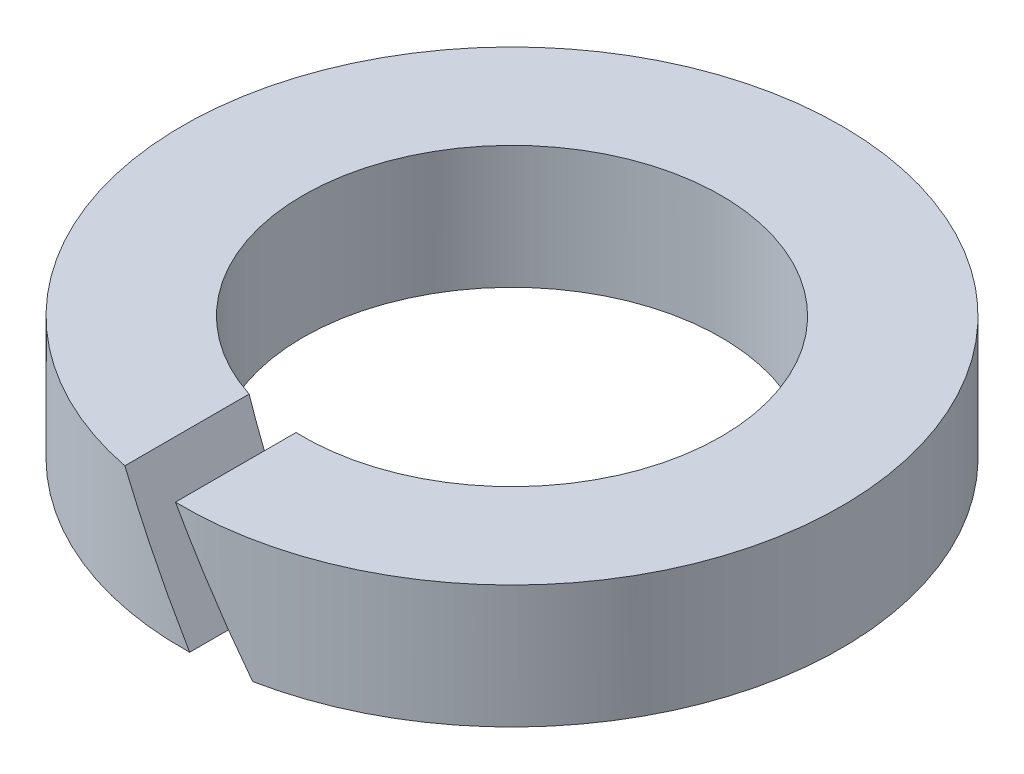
ISO-10303-21;
HEADER;
FILE_DESCRIPTION(('STEP AP214'),'2;1');
FILE_NAME('part.step','',(''),(''),'','','');
FILE_SCHEMA(('AUTOMOTIVE_DESIGN { 1 0 10303 214 1 1 1 1 }'));
ENDSEC;
DATA;
#1=APPLICATION_CONTEXT('core data for automotive mechanical design processes');
#2=APPLICATION_PROTOCOL_DEFINITION('international standard','automotive_design',2000,#1);
#3=PRODUCT_CONTEXT('',#1,'mechanical');
#4=PRODUCT('Part','Part','',(#3));
#5=PRODUCT_RELATED_PRODUCT_CATEGORY('part','',(#4));
#6=PRODUCT_DEFINITION_FORMATION('','',#4);
#7=PRODUCT_DEFINITION_CONTEXT('part definition',#1,'design');
#8=PRODUCT_DEFINITION('design','',#6,#7);
#9=PRODUCT_DEFINITION_SHAPE('','',#8);
#10=(LENGTH_UNIT() NAMED_UNIT(*) SI_UNIT(.MILLI.,.METRE.));
#11=(NAMED_UNIT(*) PLANE_ANGLE_UNIT() SI_UNIT($,.RADIAN.));
#12=(NAMED_UNIT(*) SI_UNIT($,.STERADIAN.) SOLID_ANGLE_UNIT());
#13=UNCERTAINTY_MEASURE_WITH_UNIT(LENGTH_MEASURE(1.E-05),#10,'distance_accuracy_value','');
#14=(GEOMETRIC_REPRESENTATION_CONTEXT(3) GLOBAL_UNCERTAINTY_ASSIGNED_CONTEXT((#13)) GLOBAL_UNIT_ASSIGNED_CONTEXT((#10,
#11,#12)) REPRESENTATION_CONTEXT('',''));
#15=CARTESIAN_POINT('',(0.,0.,0.));
#16=DIRECTION('',(0.,0.,1.));
#17=DIRECTION('',(1.,0.,0.));
#18=AXIS2_PLACEMENT_3D('',#15,#16,#17);
#19=CARTESIAN_POINT('',(0.,80.,-6.66133814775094E-13));
#20=DIRECTION('',(0.,1.,0.));
#21=DIRECTION('',(0.,0.,1.00000000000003));
#22=AXIS2_PLACEMENT_3D('',#19,#20,#21);
#23=CYLINDRICAL_SURFACE('',#22,4.25000000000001);
#24=CARTESIAN_POINT('',(0.,1.00000000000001,0.));
#25=DIRECTION('',(-0.866025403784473,-0.499999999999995,0.));
#26=DIRECTION('',(-0.500000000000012,0.866025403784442,0.));
#27=AXIS2_PLACEMENT_3D('',#24,#25,#26);
#28=ELLIPSE('',#27,8.5000000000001,4.25000000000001);
#29=CARTESIAN_POINT('',(1.29903810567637,-1.24999999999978,4.04660351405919));
#30=VERTEX_POINT('',#29);
#31=CARTESIAN_POINT('',(-0.144337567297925,1.25,4.24754831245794));
#32=VERTEX_POINT('',#31);
#33=EDGE_CURVE('E88',#30,#32,#28,.T.);
#34=ORIENTED_EDGE('',*,*,#33,.T.);
#35=CARTESIAN_POINT('',(0.,1.25,0.));
#36=DIRECTION('',(0.,1.,0.));
#37=DIRECTION('',(0.,0.,1.00000000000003));
#38=AXIS2_PLACEMENT_3D('',#35,#36,#37);
#39=CIRCLE('',#38,4.25000000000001);
#40=CARTESIAN_POINT('',(-1.29903810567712,1.25000000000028,4.04660351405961));
#41=VERTEX_POINT('',#40);
#42=EDGE_CURVE('E92',#32,#41,#39,.T.);
#43=ORIENTED_EDGE('',*,*,#42,.T.);
#44=CARTESIAN_POINT('',(0.,-1.00000000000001,0.));
#45=DIRECTION('',(-0.866025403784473,-0.499999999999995,0.));
#46=DIRECTION('',(-0.500000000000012,0.866025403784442,0.));
#47=AXIS2_PLACEMENT_3D('',#44,#45,#46);
#48=ELLIPSE('',#47,8.50000000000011,4.25000000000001);
#49=CARTESIAN_POINT('',(0.144337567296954,-1.25,4.24754831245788));
#50=VERTEX_POINT('',#49);
#51=EDGE_CURVE('E48',#50,#41,#48,.T.);
#52=ORIENTED_EDGE('',*,*,#51,.F.);
#53=CARTESIAN_POINT('',(0.,-1.25,0.));
#54=DIRECTION('',(0.,1.,0.));
#55=DIRECTION('',(0.,0.,1.00000000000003));
#56=AXIS2_PLACEMENT_3D('',#53,#54,#55);
#57=CIRCLE('',#56,4.25000000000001);
#58=EDGE_CURVE('E11',#30,#50,#57,.T.);
#59=ORIENTED_EDGE('',*,*,#58,.F.);
#60=EDGE_LOOP('',(#34,#43,#52,#59));
#61=FACE_BOUND('',#60,.T.);
#62=ADVANCED_FACE('F34',(#61),#23,.F.);
#63=CARTESIAN_POINT('',(6.69999999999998,-1.24999999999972,-1.52655665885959E-13));
#64=DIRECTION('',(0.,-1.,0.));
#65=DIRECTION('',(0.,0.,-1.00000000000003));
#66=AXIS2_PLACEMENT_3D('',#63,#64,#65);
#67=PLANE('',#66);
#68=CARTESIAN_POINT('',(0.,-1.25,0.));
#69=DIRECTION('',(0.,1.,0.));
#70=DIRECTION('',(0.,0.,1.00000000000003));
#71=AXIS2_PLACEMENT_3D('',#68,#69,#70);
#72=CIRCLE('',#71,6.70000000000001);
#73=CARTESIAN_POINT('',(1.29903810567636,-1.25000000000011,6.57286086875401));
#74=VERTEX_POINT('',#73);
#75=CARTESIAN_POINT('',(0.144337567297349,-1.25000000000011,6.69844509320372));
#76=VERTEX_POINT('',#75);
#77=EDGE_CURVE('E41',#74,#76,#72,.T.);
#78=ORIENTED_EDGE('',*,*,#77,.F.);
#79=DIRECTION('',(0.,0.,-1.00000000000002));
#80=VECTOR('',#79,1.);
#81=CARTESIAN_POINT('',(1.29903810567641,-1.25000000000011,6.70099999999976));
#82=LINE('',#81,#80);
#83=EDGE_CURVE('E81',#74,#30,#82,.T.);
#84=ORIENTED_EDGE('',*,*,#83,.T.);
#85=ORIENTED_EDGE('',*,*,#58,.T.);
#86=DIRECTION('',(0.,0.,-1.00000000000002));
#87=VECTOR('',#86,1.);
#88=CARTESIAN_POINT('',(0.144337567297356,-1.25000000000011,6.70099999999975));
#89=LINE('',#88,#87);
#90=EDGE_CURVE('E75',#76,#50,#89,.T.);
#91=ORIENTED_EDGE('',*,*,#90,.F.);
#92=EDGE_LOOP('',(#78,#84,#85,#91));
#93=FACE_BOUND('',#92,.T.);
#94=ADVANCED_FACE('F85',(#93),#67,.T.);
#95=CARTESIAN_POINT('',(0.,80.,-6.66133814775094E-13));
#96=DIRECTION('',(0.,1.,0.));
#97=DIRECTION('',(0.,0.,1.00000000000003));
#98=AXIS2_PLACEMENT_3D('',#95,#96,#97);
#99=CYLINDRICAL_SURFACE('',#98,6.70000000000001);
#100=CARTESIAN_POINT('',(0.,1.00000000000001,0.));
#101=DIRECTION('',(-0.866025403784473,-0.499999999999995,0.));
#102=DIRECTION('',(-0.500000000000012,0.866025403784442,0.));
#103=AXIS2_PLACEMENT_3D('',#100,#101,#102);
#104=ELLIPSE('',#103,13.4000000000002,6.70000000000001);
#105=CARTESIAN_POINT('',(-0.144337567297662,1.24999999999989,6.69844509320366));
#106=VERTEX_POINT('',#105);
#107=EDGE_CURVE('E56',#106,#74,#104,.F.);
#108=ORIENTED_EDGE('',*,*,#107,.T.);
#109=ORIENTED_EDGE('',*,*,#77,.T.);
#110=CARTESIAN_POINT('',(0.,-1.00000000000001,0.));
#111=DIRECTION('',(-0.866025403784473,-0.499999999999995,0.));
#112=DIRECTION('',(-0.500000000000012,0.866025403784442,0.));
#113=AXIS2_PLACEMENT_3D('',#110,#111,#112);
#114=ELLIPSE('',#113,13.4000000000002,6.70000000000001);
#115=CARTESIAN_POINT('',(-1.29903810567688,1.24999999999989,6.57286086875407));
#116=VERTEX_POINT('',#115);
#117=EDGE_CURVE('E72',#116,#76,#114,.F.);
#118=ORIENTED_EDGE('',*,*,#117,.F.);
#119=CARTESIAN_POINT('',(0.,1.25,0.));
#120=DIRECTION('',(0.,1.,0.));
#121=DIRECTION('',(0.,0.,1.00000000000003));
#122=AXIS2_PLACEMENT_3D('',#119,#120,#121);
#123=CIRCLE('',#122,6.70000000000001);
#124=EDGE_CURVE('E91',#106,#116,#123,.T.);
#125=ORIENTED_EDGE('',*,*,#124,.F.);
#126=EDGE_LOOP('',(#108,#109,#118,#125));
#127=FACE_BOUND('',#126,.T.);
#128=ADVANCED_FACE('F90',(#127),#99,.T.);
#129=CARTESIAN_POINT('',(4.24999999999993,1.25000000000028,0.));
#130=DIRECTION('',(0.,1.,0.));
#131=DIRECTION('',(0.,0.,1.00000000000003));
#132=AXIS2_PLACEMENT_3D('',#129,#130,#131);
#133=PLANE('',#132);
#134=ORIENTED_EDGE('',*,*,#42,.F.);
#135=DIRECTION('',(0.,0.,-1.00000000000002));
#136=VECTOR('',#135,1.);
#137=CARTESIAN_POINT('',(-0.144337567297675,1.24999999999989,6.70099999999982));
#138=LINE('',#137,#136);
#139=EDGE_CURVE('E99',#106,#32,#138,.T.);
#140=ORIENTED_EDGE('',*,*,#139,.F.);
#141=ORIENTED_EDGE('',*,*,#124,.T.);
#142=DIRECTION('',(0.,0.,-1.00000000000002));
#143=VECTOR('',#142,1.);
#144=CARTESIAN_POINT('',(-1.29903810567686,1.24999999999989,6.70099999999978));
#145=LINE('',#144,#143);
#146=EDGE_CURVE('E76',#116,#41,#145,.T.);
#147=ORIENTED_EDGE('',*,*,#146,.T.);
#148=EDGE_LOOP('',(#134,#140,#141,#147));
#149=FACE_BOUND('',#148,.T.);
#150=ADVANCED_FACE('F107',(#149),#133,.T.);
#151=CARTESIAN_POINT('',(0.144337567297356,-1.25000000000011,6.70099999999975));
#152=DIRECTION('',(-0.866025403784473,-0.499999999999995,0.));
#153=DIRECTION('',(0.500000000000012,-0.866025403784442,0.));
#154=AXIS2_PLACEMENT_3D('',#151,#152,#153);
#155=PLANE('',#154);
#156=ORIENTED_EDGE('',*,*,#51,.T.);
#157=ORIENTED_EDGE('',*,*,#146,.F.);
#158=ORIENTED_EDGE('',*,*,#117,.T.);
#159=ORIENTED_EDGE('',*,*,#90,.T.);
#160=EDGE_LOOP('',(#156,#157,#158,#159));
#161=FACE_BOUND('',#160,.T.);
#162=ADVANCED_FACE('F74',(#161),#155,.F.);
#163=CARTESIAN_POINT('',(1.29903810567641,-1.25000000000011,6.70099999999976));
#164=DIRECTION('',(-0.866025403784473,-0.499999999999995,0.));
#165=DIRECTION('',(0.500000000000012,-0.866025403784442,0.));
#166=AXIS2_PLACEMENT_3D('',#163,#164,#165);
#167=PLANE('',#166);
#168=ORIENTED_EDGE('',*,*,#83,.F.);
#169=ORIENTED_EDGE('',*,*,#107,.F.);
#170=ORIENTED_EDGE('',*,*,#139,.T.);
#171=ORIENTED_EDGE('',*,*,#33,.F.);
#172=EDGE_LOOP('',(#168,#169,#170,#171));
#173=FACE_BOUND('',#172,.T.);
#174=ADVANCED_FACE('F108',(#173),#167,.T.);
#175=CLOSED_SHELL('',(#62,#94,#128,#150,#162,#174));
#176=MANIFOLD_SOLID_BREP('B2',#175);
#177=ADVANCED_BREP_SHAPE_REPRESENTATION('',(#18,#176),#14);
#178=SHAPE_DEFINITION_REPRESENTATION(#9,#177);
ENDSEC;
END-ISO-10303-21;
